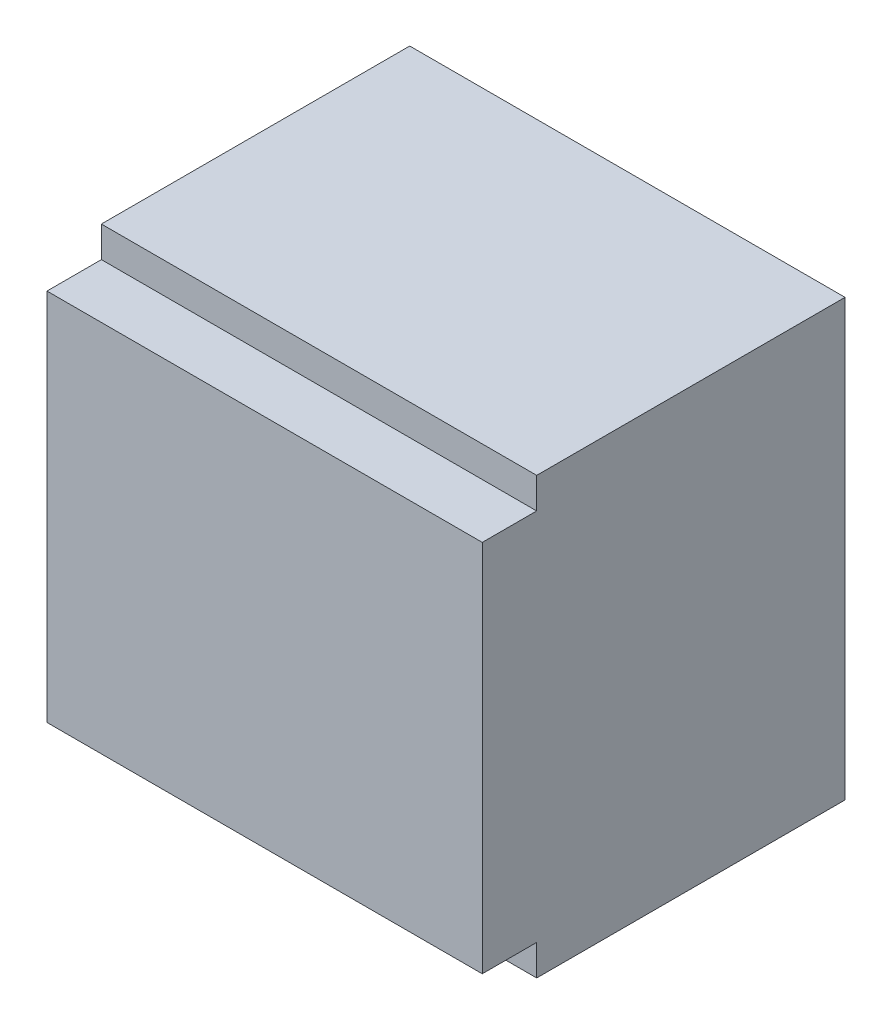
ISO-10303-21;
HEADER;
FILE_DESCRIPTION(('STEP AP214'),'2;1');
FILE_NAME('part.step','',(''),(''),'','','');
FILE_SCHEMA(('AUTOMOTIVE_DESIGN { 1 0 10303 214 1 1 1 1 }'));
ENDSEC;
DATA;
#1=APPLICATION_CONTEXT('core data for automotive mechanical design processes');
#2=APPLICATION_PROTOCOL_DEFINITION('international standard','automotive_design',2000,#1);
#3=PRODUCT_CONTEXT('',#1,'mechanical');
#4=PRODUCT('Part','Part','',(#3));
#5=PRODUCT_RELATED_PRODUCT_CATEGORY('part','',(#4));
#6=PRODUCT_DEFINITION_FORMATION('','',#4);
#7=PRODUCT_DEFINITION_CONTEXT('part definition',#1,'design');
#8=PRODUCT_DEFINITION('design','',#6,#7);
#9=PRODUCT_DEFINITION_SHAPE('','',#8);
#10=(LENGTH_UNIT() NAMED_UNIT(*) SI_UNIT(.MILLI.,.METRE.));
#11=(NAMED_UNIT(*) PLANE_ANGLE_UNIT() SI_UNIT($,.RADIAN.));
#12=(NAMED_UNIT(*) SI_UNIT($,.STERADIAN.) SOLID_ANGLE_UNIT());
#13=UNCERTAINTY_MEASURE_WITH_UNIT(LENGTH_MEASURE(1.E-05),#10,'distance_accuracy_value','');
#14=(GEOMETRIC_REPRESENTATION_CONTEXT(3) GLOBAL_UNCERTAINTY_ASSIGNED_CONTEXT((#13)) GLOBAL_UNIT_ASSIGNED_CONTEXT((#10,
#11,#12)) REPRESENTATION_CONTEXT('',''));
#15=CARTESIAN_POINT('',(0.,0.,0.));
#16=DIRECTION('',(0.,0.,1.));
#17=DIRECTION('',(1.,0.,0.));
#18=AXIS2_PLACEMENT_3D('',#15,#16,#17);
#19=CARTESIAN_POINT('',(-6.,5.15,10.));
#20=DIRECTION('',(0.,-1.,0.));
#21=DIRECTION('',(0.,0.,-1.));
#22=AXIS2_PLACEMENT_3D('',#19,#20,#21);
#23=PLANE('',#22);
#24=DIRECTION('',(0.,0.,-1.));
#25=VECTOR('',#24,1.);
#26=CARTESIAN_POINT('',(-6.,5.15,10.));
#27=LINE('',#26,#25);
#28=CARTESIAN_POINT('',(-6.,5.15,10.));
#29=VERTEX_POINT('',#28);
#30=CARTESIAN_POINT('',(-6.,5.15,8.5));
#31=VERTEX_POINT('',#30);
#32=EDGE_CURVE('E91',#29,#31,#27,.T.);
#33=ORIENTED_EDGE('',*,*,#32,.F.);
#34=DIRECTION('',(1.,0.,0.));
#35=VECTOR('',#34,1.);
#36=CARTESIAN_POINT('',(-6.,5.15,10.));
#37=LINE('',#36,#35);
#38=CARTESIAN_POINT('',(6.,5.15,10.));
#39=VERTEX_POINT('',#38);
#40=EDGE_CURVE('E148',#39,#29,#37,.F.);
#41=ORIENTED_EDGE('',*,*,#40,.F.);
#42=DIRECTION('',(0.,0.,-1.));
#43=VECTOR('',#42,1.);
#44=CARTESIAN_POINT('',(6.,5.15,10.));
#45=LINE('',#44,#43);
#46=CARTESIAN_POINT('',(6.,5.15,8.5));
#47=VERTEX_POINT('',#46);
#48=EDGE_CURVE('E108',#47,#39,#45,.F.);
#49=ORIENTED_EDGE('',*,*,#48,.F.);
#50=DIRECTION('',(-1.,0.,0.));
#51=VECTOR('',#50,1.);
#52=CARTESIAN_POINT('',(-6.,5.15,8.5));
#53=LINE('',#52,#51);
#54=EDGE_CURVE('E151',#47,#31,#53,.T.);
#55=ORIENTED_EDGE('',*,*,#54,.T.);
#56=EDGE_LOOP('',(#33,#41,#49,#55));
#57=FACE_BOUND('',#56,.T.);
#58=ADVANCED_FACE('F15',(#57),#23,.F.);
#59=CARTESIAN_POINT('',(-6.,-5.15,10.));
#60=DIRECTION('',(0.,-1.,0.));
#61=DIRECTION('',(0.,0.,-1.));
#62=AXIS2_PLACEMENT_3D('',#59,#60,#61);
#63=PLANE('',#62);
#64=DIRECTION('',(1.,0.,0.));
#65=VECTOR('',#64,1.);
#66=CARTESIAN_POINT('',(-6.,-5.15,8.5));
#67=LINE('',#66,#65);
#68=CARTESIAN_POINT('',(6.,-5.15,8.5));
#69=VERTEX_POINT('',#68);
#70=CARTESIAN_POINT('',(-6.,-5.15,8.5));
#71=VERTEX_POINT('',#70);
#72=EDGE_CURVE('E84',#69,#71,#67,.F.);
#73=ORIENTED_EDGE('',*,*,#72,.F.);
#74=DIRECTION('',(0.,0.,-1.));
#75=VECTOR('',#74,1.);
#76=CARTESIAN_POINT('',(6.,-5.15,10.));
#77=LINE('',#76,#75);
#78=CARTESIAN_POINT('',(6.,-5.15,10.));
#79=VERTEX_POINT('',#78);
#80=EDGE_CURVE('E75',#69,#79,#77,.F.);
#81=ORIENTED_EDGE('',*,*,#80,.T.);
#82=DIRECTION('',(1.,0.,0.));
#83=VECTOR('',#82,1.);
#84=CARTESIAN_POINT('',(-6.,-5.15,10.));
#85=LINE('',#84,#83);
#86=CARTESIAN_POINT('',(-6.,-5.15,10.));
#87=VERTEX_POINT('',#86);
#88=EDGE_CURVE('E87',#87,#79,#85,.T.);
#89=ORIENTED_EDGE('',*,*,#88,.F.);
#90=DIRECTION('',(0.,0.,-1.));
#91=VECTOR('',#90,1.);
#92=CARTESIAN_POINT('',(-6.,-5.15,10.));
#93=LINE('',#92,#91);
#94=EDGE_CURVE('E80',#87,#71,#93,.T.);
#95=ORIENTED_EDGE('',*,*,#94,.T.);
#96=EDGE_LOOP('',(#73,#81,#89,#95));
#97=FACE_BOUND('',#96,.T.);
#98=ADVANCED_FACE('F82',(#97),#63,.T.);
#99=CARTESIAN_POINT('',(-6.,-5.15,8.5));
#100=DIRECTION('',(0.,0.,1.));
#101=DIRECTION('',(1.,0.,0.));
#102=AXIS2_PLACEMENT_3D('',#99,#100,#101);
#103=PLANE('',#102);
#104=DIRECTION('',(1.,0.,0.));
#105=VECTOR('',#104,1.);
#106=CARTESIAN_POINT('',(-6.,-6.,8.5));
#107=LINE('',#106,#105);
#108=CARTESIAN_POINT('',(6.,-6.,8.5));
#109=VERTEX_POINT('',#108);
#110=CARTESIAN_POINT('',(-6.,-6.,8.5));
#111=VERTEX_POINT('',#110);
#112=EDGE_CURVE('E145',#109,#111,#107,.F.);
#113=ORIENTED_EDGE('',*,*,#112,.F.);
#114=DIRECTION('',(0.,1.,0.));
#115=VECTOR('',#114,1.);
#116=CARTESIAN_POINT('',(6.,-5.15,8.5));
#117=LINE('',#116,#115);
#118=EDGE_CURVE('E101',#109,#69,#117,.T.);
#119=ORIENTED_EDGE('',*,*,#118,.T.);
#120=ORIENTED_EDGE('',*,*,#72,.T.);
#121=DIRECTION('',(0.,1.,0.));
#122=VECTOR('',#121,1.);
#123=CARTESIAN_POINT('',(-6.,-5.15,8.5));
#124=LINE('',#123,#122);
#125=EDGE_CURVE('E94',#71,#111,#124,.F.);
#126=ORIENTED_EDGE('',*,*,#125,.T.);
#127=EDGE_LOOP('',(#113,#119,#120,#126));
#128=FACE_BOUND('',#127,.T.);
#129=ADVANCED_FACE('F103',(#128),#103,.T.);
#130=CARTESIAN_POINT('',(-6.,5.15,8.5));
#131=DIRECTION('',(0.,0.,-1.));
#132=DIRECTION('',(-1.,0.,0.));
#133=AXIS2_PLACEMENT_3D('',#130,#131,#132);
#134=PLANE('',#133);
#135=DIRECTION('',(0.,1.,0.));
#136=VECTOR('',#135,1.);
#137=CARTESIAN_POINT('',(-6.,-6.,8.5));
#138=LINE('',#137,#136);
#139=CARTESIAN_POINT('',(-6.,6.,8.5));
#140=VERTEX_POINT('',#139);
#141=EDGE_CURVE('E140',#31,#140,#138,.T.);
#142=ORIENTED_EDGE('',*,*,#141,.F.);
#143=ORIENTED_EDGE('',*,*,#54,.F.);
#144=DIRECTION('',(0.,1.,0.));
#145=VECTOR('',#144,1.);
#146=CARTESIAN_POINT('',(6.,5.15,8.5));
#147=LINE('',#146,#145);
#148=CARTESIAN_POINT('',(6.,6.,8.5));
#149=VERTEX_POINT('',#148);
#150=EDGE_CURVE('E154',#149,#47,#147,.F.);
#151=ORIENTED_EDGE('',*,*,#150,.F.);
#152=DIRECTION('',(1.,0.,0.));
#153=VECTOR('',#152,1.);
#154=CARTESIAN_POINT('',(-6.,6.,8.5));
#155=LINE('',#154,#153);
#156=EDGE_CURVE('E135',#140,#149,#155,.T.);
#157=ORIENTED_EDGE('',*,*,#156,.F.);
#158=EDGE_LOOP('',(#142,#143,#151,#157));
#159=FACE_BOUND('',#158,.T.);
#160=ADVANCED_FACE('F161',(#159),#134,.F.);
#161=CARTESIAN_POINT('',(-6.,5.15,10.));
#162=DIRECTION('',(0.,0.,1.));
#163=DIRECTION('',(1.,0.,0.));
#164=AXIS2_PLACEMENT_3D('',#161,#162,#163);
#165=PLANE('',#164);
#166=ORIENTED_EDGE('',*,*,#88,.T.);
#167=DIRECTION('',(0.,1.,0.));
#168=VECTOR('',#167,1.);
#169=CARTESIAN_POINT('',(6.,-6.,10.));
#170=LINE('',#169,#168);
#171=EDGE_CURVE('E129',#79,#39,#170,.T.);
#172=ORIENTED_EDGE('',*,*,#171,.T.);
#173=ORIENTED_EDGE('',*,*,#40,.T.);
#174=DIRECTION('',(0.,1.,0.));
#175=VECTOR('',#174,1.);
#176=CARTESIAN_POINT('',(-6.,-6.,10.));
#177=LINE('',#176,#175);
#178=EDGE_CURVE('E142',#87,#29,#177,.T.);
#179=ORIENTED_EDGE('',*,*,#178,.F.);
#180=EDGE_LOOP('',(#166,#172,#173,#179));
#181=FACE_BOUND('',#180,.T.);
#182=ADVANCED_FACE('F163',(#181),#165,.T.);
#183=CARTESIAN_POINT('',(-6.,-6.,8.5));
#184=DIRECTION('',(0.,-1.,0.));
#185=DIRECTION('',(0.,0.,-1.));
#186=AXIS2_PLACEMENT_3D('',#183,#184,#185);
#187=PLANE('',#186);
#188=DIRECTION('',(-1.,0.,0.));
#189=VECTOR('',#188,1.);
#190=CARTESIAN_POINT('',(-6.,-6.,0.));
#191=LINE('',#190,#189);
#192=CARTESIAN_POINT('',(6.,-6.,0.));
#193=VERTEX_POINT('',#192);
#194=CARTESIAN_POINT('',(-6.,-6.,0.));
#195=VERTEX_POINT('',#194);
#196=EDGE_CURVE('E125',#193,#195,#191,.T.);
#197=ORIENTED_EDGE('',*,*,#196,.F.);
#198=DIRECTION('',(0.,0.,1.));
#199=VECTOR('',#198,1.);
#200=CARTESIAN_POINT('',(6.,-6.,0.));
#201=LINE('',#200,#199);
#202=EDGE_CURVE('E132',#193,#109,#201,.T.);
#203=ORIENTED_EDGE('',*,*,#202,.T.);
#204=ORIENTED_EDGE('',*,*,#112,.T.);
#205=DIRECTION('',(0.,0.,1.));
#206=VECTOR('',#205,1.);
#207=CARTESIAN_POINT('',(-6.,-6.,0.));
#208=LINE('',#207,#206);
#209=EDGE_CURVE('E97',#195,#111,#208,.T.);
#210=ORIENTED_EDGE('',*,*,#209,.F.);
#211=EDGE_LOOP('',(#197,#203,#204,#210));
#212=FACE_BOUND('',#211,.T.);
#213=ADVANCED_FACE('F165',(#212),#187,.T.);
#214=CARTESIAN_POINT('',(-6.,-6.,0.));
#215=DIRECTION('',(-1.,0.,0.));
#216=DIRECTION('',(0.,0.,1.));
#217=AXIS2_PLACEMENT_3D('',#214,#215,#216);
#218=PLANE('',#217);
#219=ORIENTED_EDGE('',*,*,#141,.T.);
#220=DIRECTION('',(0.,0.,1.));
#221=VECTOR('',#220,1.);
#222=CARTESIAN_POINT('',(-6.,6.,0.));
#223=LINE('',#222,#221);
#224=CARTESIAN_POINT('',(-6.,6.,0.));
#225=VERTEX_POINT('',#224);
#226=EDGE_CURVE('E137',#225,#140,#223,.T.);
#227=ORIENTED_EDGE('',*,*,#226,.F.);
#228=DIRECTION('',(0.,1.,0.));
#229=VECTOR('',#228,1.);
#230=CARTESIAN_POINT('',(-6.,-6.,0.));
#231=LINE('',#230,#229);
#232=EDGE_CURVE('E122',#195,#225,#231,.T.);
#233=ORIENTED_EDGE('',*,*,#232,.F.);
#234=ORIENTED_EDGE('',*,*,#209,.T.);
#235=ORIENTED_EDGE('',*,*,#125,.F.);
#236=ORIENTED_EDGE('',*,*,#94,.F.);
#237=ORIENTED_EDGE('',*,*,#178,.T.);
#238=ORIENTED_EDGE('',*,*,#32,.T.);
#239=EDGE_LOOP('',(#219,#227,#233,#234,#235,#236,#237,#238));
#240=FACE_BOUND('',#239,.T.);
#241=ADVANCED_FACE('F95',(#240),#218,.T.);
#242=CARTESIAN_POINT('',(-6.,6.,0.));
#243=DIRECTION('',(0.,1.,0.));
#244=DIRECTION('',(0.,0.,1.));
#245=AXIS2_PLACEMENT_3D('',#242,#243,#244);
#246=PLANE('',#245);
#247=DIRECTION('',(0.,0.,1.));
#248=VECTOR('',#247,1.);
#249=CARTESIAN_POINT('',(6.,6.,0.));
#250=LINE('',#249,#248);
#251=CARTESIAN_POINT('',(6.,6.,0.));
#252=VERTEX_POINT('',#251);
#253=EDGE_CURVE('E31',#149,#252,#250,.F.);
#254=ORIENTED_EDGE('',*,*,#253,.T.);
#255=DIRECTION('',(-1.,0.,0.));
#256=VECTOR('',#255,1.);
#257=CARTESIAN_POINT('',(-6.,6.,0.));
#258=LINE('',#257,#256);
#259=EDGE_CURVE('E119',#225,#252,#258,.F.);
#260=ORIENTED_EDGE('',*,*,#259,.F.);
#261=ORIENTED_EDGE('',*,*,#226,.T.);
#262=ORIENTED_EDGE('',*,*,#156,.T.);
#263=EDGE_LOOP('',(#254,#260,#261,#262));
#264=FACE_BOUND('',#263,.T.);
#265=ADVANCED_FACE('F194',(#264),#246,.T.);
#266=CARTESIAN_POINT('',(6.,-6.,0.));
#267=DIRECTION('',(-1.,0.,0.));
#268=DIRECTION('',(0.,0.,1.));
#269=AXIS2_PLACEMENT_3D('',#266,#267,#268);
#270=PLANE('',#269);
#271=ORIENTED_EDGE('',*,*,#253,.F.);
#272=ORIENTED_EDGE('',*,*,#150,.T.);
#273=ORIENTED_EDGE('',*,*,#48,.T.);
#274=ORIENTED_EDGE('',*,*,#171,.F.);
#275=ORIENTED_EDGE('',*,*,#80,.F.);
#276=ORIENTED_EDGE('',*,*,#118,.F.);
#277=ORIENTED_EDGE('',*,*,#202,.F.);
#278=DIRECTION('',(0.,1.,0.));
#279=VECTOR('',#278,1.);
#280=CARTESIAN_POINT('',(6.,-6.,0.));
#281=LINE('',#280,#279);
#282=EDGE_CURVE('E23',#252,#193,#281,.F.);
#283=ORIENTED_EDGE('',*,*,#282,.F.);
#284=EDGE_LOOP('',(#271,#272,#273,#274,#275,#276,#277,#283));
#285=FACE_BOUND('',#284,.T.);
#286=ADVANCED_FACE('F155',(#285),#270,.F.);
#287=CARTESIAN_POINT('',(0.,0.,6.5));
#288=DIRECTION('',(0.,0.,-1.));
#289=DIRECTION('',(-1.,0.,0.));
#290=AXIS2_PLACEMENT_3D('',#287,#288,#289);
#291=CYLINDRICAL_SURFACE('',#290,2.5);
#292=CARTESIAN_POINT('',(0.,0.,5.8));
#293=DIRECTION('',(0.,0.,-1.));
#294=DIRECTION('',(-1.,0.,0.));
#295=AXIS2_PLACEMENT_3D('',#292,#293,#294);
#296=CIRCLE('',#295,2.5);
#297=CARTESIAN_POINT('',(-2.5,0.,5.8));
#298=VERTEX_POINT('',#297);
#299=EDGE_CURVE('E109',#298,#298,#296,.T.);
#300=ORIENTED_EDGE('',*,*,#299,.F.);
#301=EDGE_LOOP('',(#300));
#302=FACE_BOUND('',#301,.T.);
#303=CARTESIAN_POINT('',(0.,0.,0.));
#304=DIRECTION('',(0.,0.,-1.));
#305=DIRECTION('',(-1.,0.,0.));
#306=AXIS2_PLACEMENT_3D('',#303,#304,#305);
#307=CIRCLE('',#306,2.5);
#308=CARTESIAN_POINT('',(-2.5,0.,0.));
#309=VERTEX_POINT('',#308);
#310=EDGE_CURVE('E9',#309,#309,#307,.F.);
#311=ORIENTED_EDGE('',*,*,#310,.F.);
#312=EDGE_LOOP('',(#311));
#313=FACE_BOUND('',#312,.T.);
#314=ADVANCED_FACE('F179',(#302,#313),#291,.F.);
#315=CARTESIAN_POINT('',(-6.,-6.,0.));
#316=DIRECTION('',(0.,0.,-1.));
#317=DIRECTION('',(-1.,0.,0.));
#318=AXIS2_PLACEMENT_3D('',#315,#316,#317);
#319=PLANE('',#318);
#320=ORIENTED_EDGE('',*,*,#310,.T.);
#321=EDGE_LOOP('',(#320));
#322=FACE_BOUND('',#321,.T.);
#323=ORIENTED_EDGE('',*,*,#259,.T.);
#324=ORIENTED_EDGE('',*,*,#282,.T.);
#325=ORIENTED_EDGE('',*,*,#196,.T.);
#326=ORIENTED_EDGE('',*,*,#232,.T.);
#327=EDGE_LOOP('',(#323,#324,#325,#326));
#328=FACE_BOUND('',#327,.T.);
#329=ADVANCED_FACE('F176',(#322,#328),#319,.T.);
#330=CARTESIAN_POINT('',(0.,0.,5.8));
#331=DIRECTION('',(0.,0.,-1.));
#332=DIRECTION('',(-1.,0.,0.));
#333=AXIS2_PLACEMENT_3D('',#330,#331,#332);
#334=PLANE('',#333);
#335=ORIENTED_EDGE('',*,*,#299,.T.);
#336=EDGE_LOOP('',(#335));
#337=FACE_BOUND('',#336,.T.);
#338=ADVANCED_FACE('F178',(#337),#334,.T.);
#339=CLOSED_SHELL('',(#58,#98,#129,#160,#182,#213,#241,#265,#286,#314,#329,#338));
#340=MANIFOLD_SOLID_BREP('B1',#339);
#341=ADVANCED_BREP_SHAPE_REPRESENTATION('',(#18,#340),#14);
#342=SHAPE_DEFINITION_REPRESENTATION(#9,#341);
ENDSEC;
END-ISO-10303-21;
